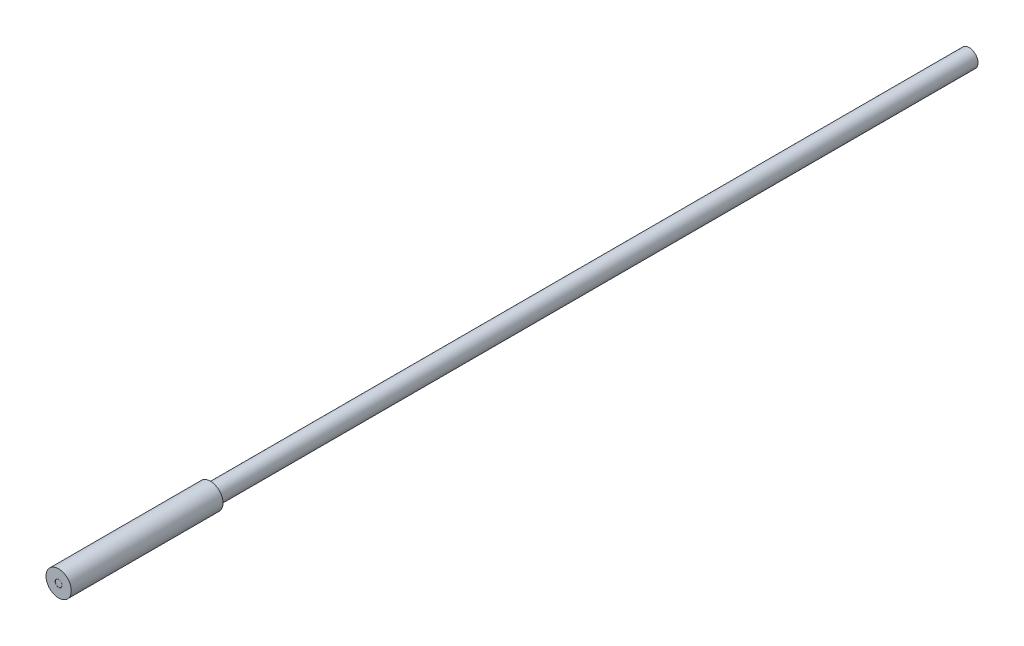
from build123d import *

# Parameters (mm, degrees)
SKETCH_1_R          = 0.5
EXTRUDE_1_DEPTH     = 6
SKETCH_2_R          = 0.35
EXTRUDE_2_DEPTH     = 30
SKETCH_3_R          = 0.1375
SKETCH_3_R_2        = 0.1325
CUT_EXTRUDE_1_DEPTH = 0.1


with BuildPart() as part:
    # Sketch 1 → Extrude 1 (new body)
    with BuildSketch(Plane.XY):
        Circle(SKETCH_1_R)
    extrude(amount=-EXTRUDE_1_DEPTH)

    # Sketch 2 → Extrude 2 (add)
    with BuildSketch(Plane(origin=(0, 0, -6), x_dir=(-1, 0, 0), z_dir=(0, 0, -1))):
        Circle(SKETCH_2_R)
    extrude(amount=EXTRUDE_2_DEPTH)

    # Sketch 3 → Cut-Extrude 1 (cut)
    with BuildSketch(Plane.XY):
        Circle(SKETCH_3_R)
        Circle(SKETCH_3_R_2, mode=Mode.SUBTRACT)
    extrude(amount=-CUT_EXTRUDE_1_DEPTH, mode=Mode.SUBTRACT)


solid = part.part
